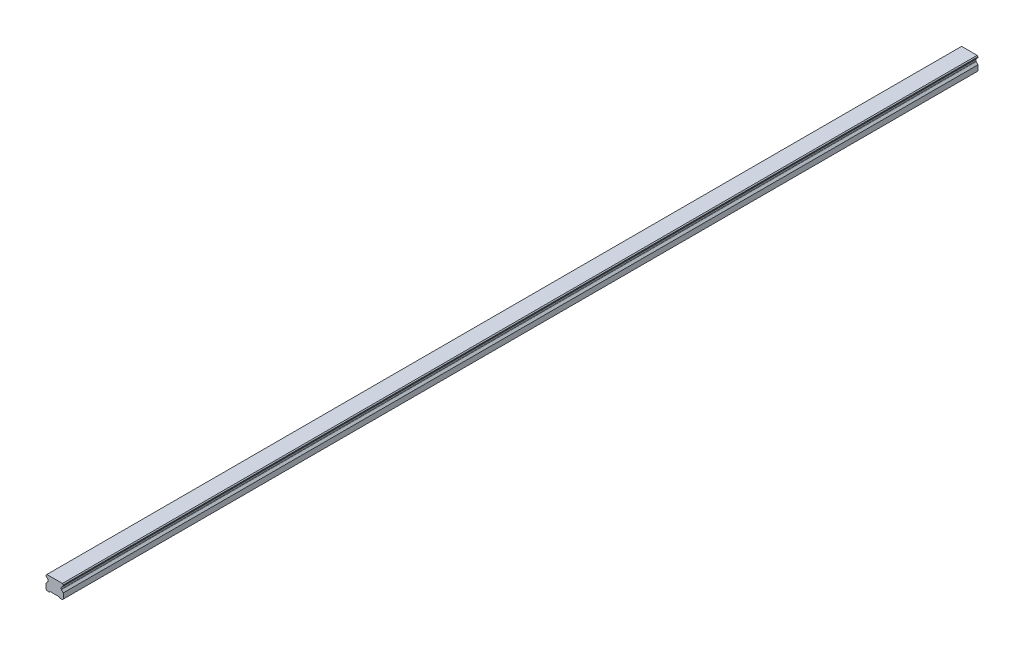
from build123d import *

# Parameters (mm, degrees)
SKETCH1_W           = 20
SKETCH1_H           = 16.3
BOSS_EXTRUDE1_DEPTH = 530
CUT_EXTRUDE1_DEPTH  = 1061.17248125
CHAMFER1_SIZE       = 1
FILLET1_R           = 1
CUT_EXTRUDE2_DEPTH  = 1061.17248125
SKETCH5_R           = 3
SKETCH5_R_2         = 2.5
CUT_EXTRUDE5_DEPTH  = 10
SKETCH5_2_R         = 2.5
CUT_EXTRUDE6_DEPTH  = 13
LPATTERN2_COUNT     = 18
LPATTERN2_PITCH     = 60


with BuildPart() as part:
    # Sketch1 → Boss-Extrude1 (new, symmetric)
    with BuildSketch(Plane.XY):
        with Locations((0, 8.15)):
            Rectangle(SKETCH1_W, SKETCH1_H)
    extrude(amount=BOSS_EXTRUDE1_DEPTH, both=True)

    # Sketch2 → Cut-Extrude1 (cut, through all)
    with BuildSketch(Plane.XY.offset(530)):
        Polygon((-10, 14.3), (-10, 7.3), (-7.666666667, 9.633333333), (-7.666666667, 11.966666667), align=None)
        Polygon((7.666666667, 11.966666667), (10, 14.3), (10, 7.3), (7.666666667, 9.633333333), align=None)
    extrude(amount=-CUT_EXTRUDE1_DEPTH, mode=Mode.SUBTRACT)

    # Chamfer1
    chamfer1_edges = [part.edges().sort_by_distance(p)[0] for p in [
        (-10, 16.3, 0),
        (10, 16.3, 0),
        (10, 0, 0),
        (-10, 0, 0),
    ]]
    chamfer(chamfer1_edges, length=CHAMFER1_SIZE)

    # Fillet1
    fillet1_edges = [part.edges().sort_by_distance(p)[0] for p in [
        (-7.666666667, 11.966666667, 0),
        (-7.666666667, 9.633333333, 0),
        (7.666666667, 9.633333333, 0),
        (7.666666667, 11.966666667, 0),
    ]]
    fillet(fillet1_edges, radius=FILLET1_R)

    # Sketch3 → Cut-Extrude2 (cut, through all)
    with BuildSketch(Plane.XY.offset(530)):
        Polygon((-6, 0), (-5, 1), (5, 1), (6, 0), align=None)
    extrude(amount=-CUT_EXTRUDE2_DEPTH, mode=Mode.SUBTRACT)

    # Sketch5 → Cut-Extrude5 (cut)
    with BuildSketch(Plane.XZ.offset(-1)):
        with Locations(Location((0, 510, 0), (0, 0, 270))):
            Circle(SKETCH5_R)
        with Locations(Location((0, 510, 0), (0, 0, 270))):
            Circle(SKETCH5_R_2, mode=Mode.SUBTRACT)
    cut_extrude5 = extrude(amount=-CUT_EXTRUDE5_DEPTH, mode=Mode.SUBTRACT)

    # Sketch5_2 → Cut-Extrude6 (cut)
    with BuildSketch(Plane.XZ.offset(-1)):
        with Locations(Location((0, 510, 0), (0, 0, 270))):
            Circle(SKETCH5_2_R)
    cut_extrude6 = extrude(amount=-CUT_EXTRUDE6_DEPTH, mode=Mode.SUBTRACT)

    # Cut-Extrude7 cone 1 section (on through the dimple's axis) → Cut-Extrude7 (revolve, cut)
    with BuildSketch(Plane(origin=(0, 14, 510), x_dir=(0, 0, -1), z_dir=(1, 0, 0))):
        Polygon((0, 0), (2.5, 0), (0, 1.443375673), align=None)
    cut_extrude7 = revolve(axis=Axis((0, 14, 510), (0, 1, 0)), mode=Mode.SUBTRACT)

    # LPattern2: Cut-Extrude5, Cut-Extrude6, Cut-Extrude7 ×18
    with Locations(*[(0, 0, -i * LPATTERN2_PITCH) for i in range(1, LPATTERN2_COUNT)]):
        add(cut_extrude5, mode=Mode.SUBTRACT)
        add(cut_extrude6, mode=Mode.SUBTRACT)
        add(cut_extrude7, mode=Mode.SUBTRACT)


solid = part.part
